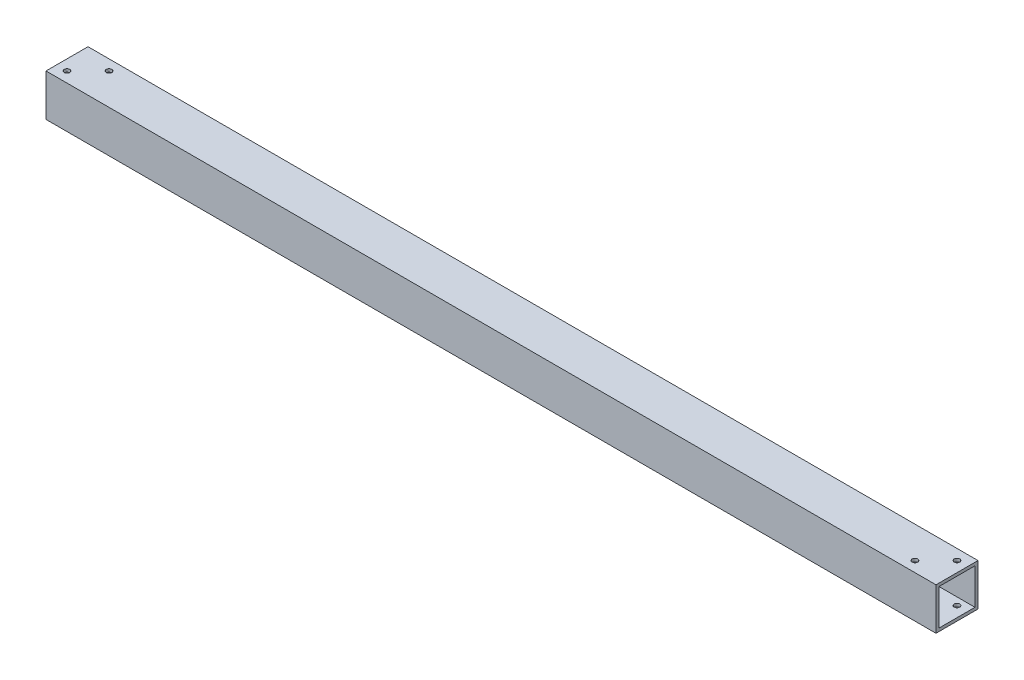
from build123d import *

# Parameters (mm, degrees)
SKETCH1_W          = 50.8
SKETCH1_H          = 50.8
SKETCH1_W_2        = 43.4848
SKETCH1_H_2        = 43.4848
EXTRUDE1_DEPTH     = 1076.198
SKETCH3_R          = 3.37312
CUT_EXTRUDE1_DEPTH = 1079.593257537


with BuildPart() as part:
    # Sketch1 → Extrude1 (new body)
    with BuildSketch(Plane(origin=(0, 0, 0), x_dir=(0, 0, -1), z_dir=(1, 0, 0))):
        with Locations((25.4, 25.4)):
            Rectangle(SKETCH1_W, SKETCH1_H)
        with Locations((25.4, 25.4)):
            Rectangle(SKETCH1_W_2, SKETCH1_H_2, mode=Mode.SUBTRACT)
    extrude(amount=EXTRUDE1_DEPTH)

    # Sketch3 → Cut-Extrude1 (cut, through all)
    with BuildSketch(Plane(origin=(0, 50.8, 0), x_dir=(1, 0, 0), z_dir=(0, 1, 0))):
        with Locations(Location((12.7, 12.7, 0), (0, 0, 270))):
            Circle(SKETCH3_R)
        with Locations(Location((38.1, 38.1, 0), (0, 0, 270))):
            Circle(SKETCH3_R)
        with Locations(Location((1063.498, 38.1, 0), (0, 0, 270))):
            Circle(SKETCH3_R)
        with Locations(Location((1038.098, 12.7, 0), (0, 0, 270))):
            Circle(SKETCH3_R)
    extrude(amount=-CUT_EXTRUDE1_DEPTH, mode=Mode.SUBTRACT)


solid = part.part
